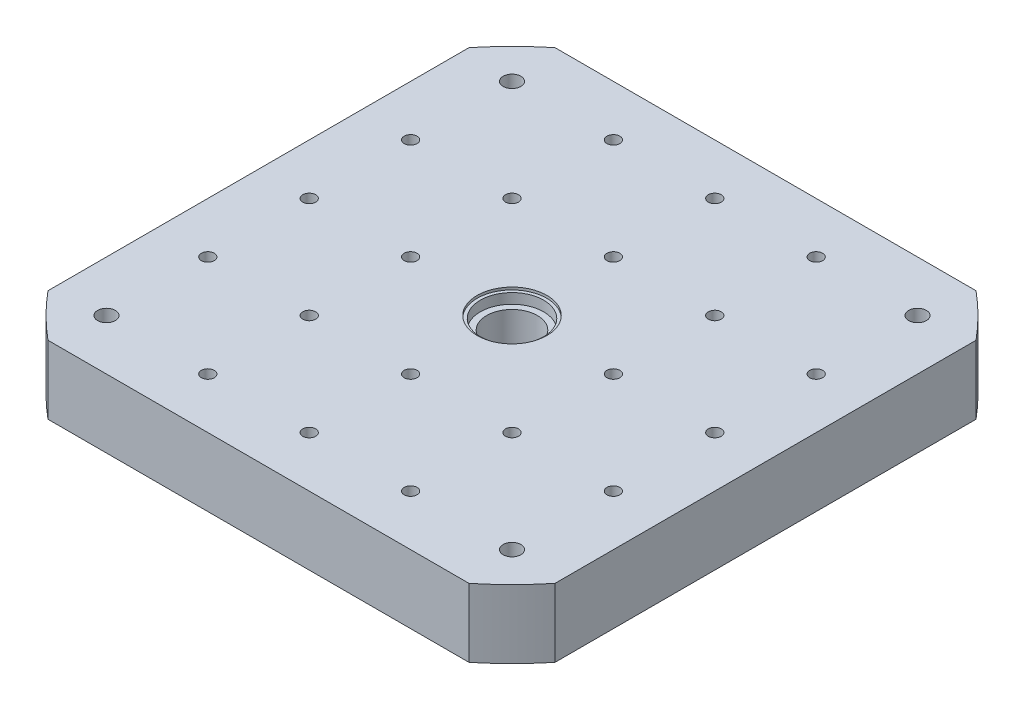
from build123d import *

# Parameters (mm, degrees)
VOLUME_TABLE_DEPTH              = 54
ESQUISSE4_R                     = 25
AL_SAGE_20_DEPTH                = 10
ESQUISSE10_R                    = 27.5
ENL_V_MAT_EXTRU_1_DEPTH         = 2
R_P_TITION_LIN_AIRE1_COUNT      = 5
R_P_TITION_LIN_AIRE1_PITCH      = 80
R_P_TITION_LIN_AIRE1_COUNT_DIR2 = 5
R_P_TITION_LIN_AIRE1_PITCH_DIR2 = 80
ENL_V_MAT_EXTRU_3_REACH         = 288.245
ESQUISSE12_R                    = 20
TROU_TARAUD_M161_D              = 14
TROU_TARAUD_M161_DEPTH          = 38
TROU_TARAUD_M161_TIP            = 4.206024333


with BuildPart() as part:
    # Esquisse1 → volume table (new body)
    with BuildSketch(Plane(origin=(0, 0, 0), x_dir=(1, 0, 0), z_dir=(0, 1, 0))):
        with BuildLine():
            Line((-166.132477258, 200), (166.132477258, 200))
            ThreePointArc((166.132477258, 200), (183.847763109, 183.847763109), (200, 166.132477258))
            Line((200, 166.132477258), (200, -166.132477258))
            ThreePointArc((200, -166.132477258), (183.847763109, -183.847763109), (166.132477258, -200))
            Line((166.132477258, -200), (-166.132477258, -200))
            ThreePointArc((-166.132477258, -200), (-183.847763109, -183.847763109), (-200, -166.132477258))
            Line((-200, -166.132477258), (-200, 166.132477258))
            ThreePointArc((-200, 166.132477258), (-183.847763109, 183.847763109), (-166.132477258, 200))
        make_face()
    extrude(amount=-VOLUME_TABLE_DEPTH)

    # Esquisse4 → al_sage _20 (cut)
    with BuildSketch(Plane(origin=(0, 0, 0), x_dir=(-1, 0, 0), z_dir=(0, 1, 0))):
        with Locations(Location((0, 0, 0), (0, 0, 90))):
            Circle(ESQUISSE4_R)
    extrude(amount=-AL_SAGE_20_DEPTH, mode=Mode.SUBTRACT)

    # Esquisse10 → Enl_v. mat.-Extru.1 (cut)
    with BuildSketch(Plane(origin=(0, 0, 0), x_dir=(1, 0, 0), z_dir=(0, 1, 0))):
        with Locations(Location((0, 0, 0), (0, 0, 270))):
            Circle(ESQUISSE10_R)
    extrude(amount=-ENL_V_MAT_EXTRU_1_DEPTH, mode=Mode.SUBTRACT)

    # Esquisse5 → Trou taraud_ M121 (revolve, cut)
    with BuildSketch(Plane(origin=(160, 0, 160), x_dir=(0, 0, 1), z_dir=(1, 0, 0))):
        Polygon((0, 0), (0, 32.314389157), (5.1, 29.25), (5.1, 0), align=None)
    trou_taraud_m121 = revolve(axis=Axis((160, 6.35, 160), (0, -1, 0)), mode=Mode.SUBTRACT)

    # R_p_tition lin_aire1: Trou taraud_ M121 5 × 5, 1 skipped
    with Locations(*[(-j * R_P_TITION_LIN_AIRE1_PITCH_DIR2, 0, -i * R_P_TITION_LIN_AIRE1_PITCH) for i in range(R_P_TITION_LIN_AIRE1_COUNT) for j in range(R_P_TITION_LIN_AIRE1_COUNT_DIR2) if (i, j) not in ((0, 0), (2, 2))]):
        add(trou_taraud_m121, mode=Mode.SUBTRACT)

    # Esquisse12 → Enl_v. mat.-Extru.3 (cut, up to next)
    with BuildSketch(Plane(origin=(0, -10, 0), x_dir=(1, 0, 0), z_dir=(0, 1, 0)), mode=Mode.PRIVATE) as enl_v_mat_extru_3_sk1:
        with Locations(Location((0, 0, 0), (0, 0, 270))):
            Circle(ESQUISSE12_R)
    enl_v_mat_extru_3_tool1 = extrude(enl_v_mat_extru_3_sk1.sketch, amount=-ENL_V_MAT_EXTRU_3_REACH, mode=Mode.PRIVATE) & part.part
    add(enl_v_mat_extru_3_tool1.solids().sort_by_distance((0, -10, 0))[0], mode=Mode.SUBTRACT)

    # Trou taraud_ M161
    with Locations(Plane(origin=(0, 0, 0), x_dir=(-1, 0, 0), z_dir=(0, 1, 0))):
        with Locations((-160, 160), (-160, -160), (160, 160), (160, -160)):
            Hole(TROU_TARAUD_M161_D / 2, depth=TROU_TARAUD_M161_DEPTH)
            with Locations((0, 0, -(TROU_TARAUD_M161_DEPTH + TROU_TARAUD_M161_TIP / 2))):  # 118° drill point
                Cone(0, TROU_TARAUD_M161_D / 2, TROU_TARAUD_M161_TIP, mode=Mode.SUBTRACT)


solid = part.part
